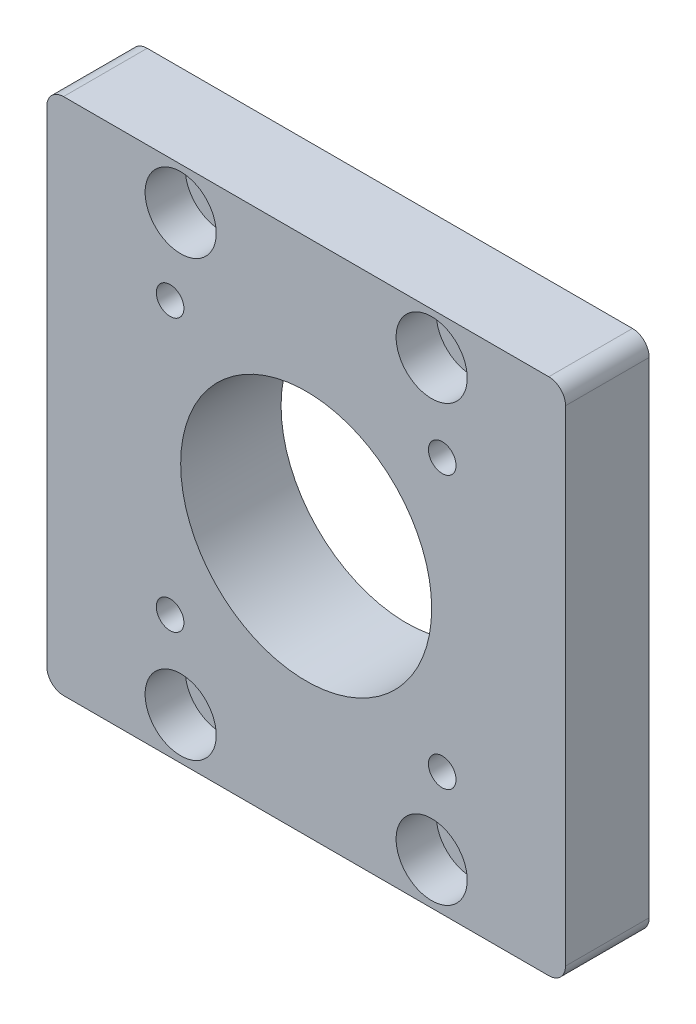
from build123d import *
from build123d.topology import SkipClean

# Parameters (mm, degrees)
SKETCH_1_W             = 62
SKETCH_1_H             = 62
SKETCH_1_R             = 15
EXTRUDE_1_DEPTH        = 10
SKETCH_2_R             = 1.65
CUT_EXTRUDE_1_DEPTH    = 45.966654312
SKETCH_5_R             = 2.25
CUT_EXTRUDE_3_DEPTH    = 45.966654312
SKETCH_6_R             = 4.25
CUT_EXTRUDE_4_DEPTH    = 4.8
FILLET_1_R             = 2
EXTRUDE_START          = 2
SKETCH_7_R             = 25
SKETCH_7_R_2           = 15
EXTRUDE_2_DEPTH        = 2
HOLE_WIZARD_M4_1_D     = 3.3
HOLE_WIZARD_M4_1_DEPTH = 13.4
HOLE_WIZARD_M4_1_TIP   = 0.991420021


with BuildPart() as part:
    # Sketch 1 → Extrude 1 (new body)
    with BuildSketch(Plane.XY):
        Rectangle(SKETCH_1_W, SKETCH_1_H)
        Circle(SKETCH_1_R, mode=Mode.SUBTRACT)
    extrude(amount=EXTRUDE_1_DEPTH)

    # Sketch 2 → Cut-Extrude 1 (cut, through all)
    with BuildSketch(Plane.XY.offset(10)):
        with Locations((-16.263455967, 16.263455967)):
            Circle(SKETCH_2_R)
        with Locations((16.263455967, 16.263455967)):
            Circle(SKETCH_2_R)
        with Locations((16.263455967, -16.263455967)):
            Circle(SKETCH_2_R)
        with Locations((-16.263455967, -16.263455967)):
            Circle(SKETCH_2_R)
    extrude(amount=-CUT_EXTRUDE_1_DEPTH, mode=Mode.SUBTRACT)

    # Sketch 5 → Cut-Extrude 3 (cut, through all)
    with BuildSketch(Plane.XY.offset(10)):
        with Locations((-15, 25.980762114)):
            Circle(SKETCH_5_R)
        with Locations((15, 25.980762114)):
            Circle(SKETCH_5_R)
        with Locations((15, -25.980762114)):
            Circle(SKETCH_5_R)
        with Locations((-15, -25.980762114)):
            Circle(SKETCH_5_R)
    extrude(amount=-CUT_EXTRUDE_3_DEPTH, mode=Mode.SUBTRACT)

    # Sketch 6 → Cut-Extrude 4 (cut)
    with BuildSketch(Plane.XY.offset(10)):
        with Locations((-15, 25.980762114)):
            Circle(SKETCH_6_R)
        with Locations((15, 25.980762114)):
            Circle(SKETCH_6_R)
        with Locations((15, -25.980762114)):
            Circle(SKETCH_6_R)
        with Locations((-15, -25.980762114)):
            Circle(SKETCH_6_R)
    extrude(amount=-CUT_EXTRUDE_4_DEPTH, mode=Mode.SUBTRACT)

    # Fillet 1
    fillet_1_edges = [part.edges().sort_by_distance(p)[0] for p in [
        (31, -31, 5),
        (-31, -31, 5),
        (-31, 31, 5),
        (31, 31, 5),
    ]]
    fillet(fillet_1_edges, radius=FILLET_1_R)

    # Sketch 7 → Extrude 2 (add)
    with SkipClean():  # the faces are left unmerged after this step: merging them gives an invalid solid
        with BuildSketch(Plane(origin=(0, 0, 0), x_dir=(-1, 0, 0), z_dir=(0, 0, -1)).offset(EXTRUDE_START)):
            Circle(SKETCH_7_R)
            Circle(SKETCH_7_R_2, mode=Mode.SUBTRACT)
        extrude(amount=-EXTRUDE_2_DEPTH)

    # Hole Wizard M4 _1
    with Locations(Plane.XY.offset(10)):
        with Locations((16.263455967, 16.263455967), (16.263455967, -16.263455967), (-16.263455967, -16.263455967), (-16.263455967, 16.263455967)):
            Hole(HOLE_WIZARD_M4_1_D / 2, depth=HOLE_WIZARD_M4_1_DEPTH)
            with Locations((0, 0, -(HOLE_WIZARD_M4_1_DEPTH + HOLE_WIZARD_M4_1_TIP / 2))):  # 118° drill point
                Cone(0, HOLE_WIZARD_M4_1_D / 2, HOLE_WIZARD_M4_1_TIP, mode=Mode.SUBTRACT)


solid = part.part
